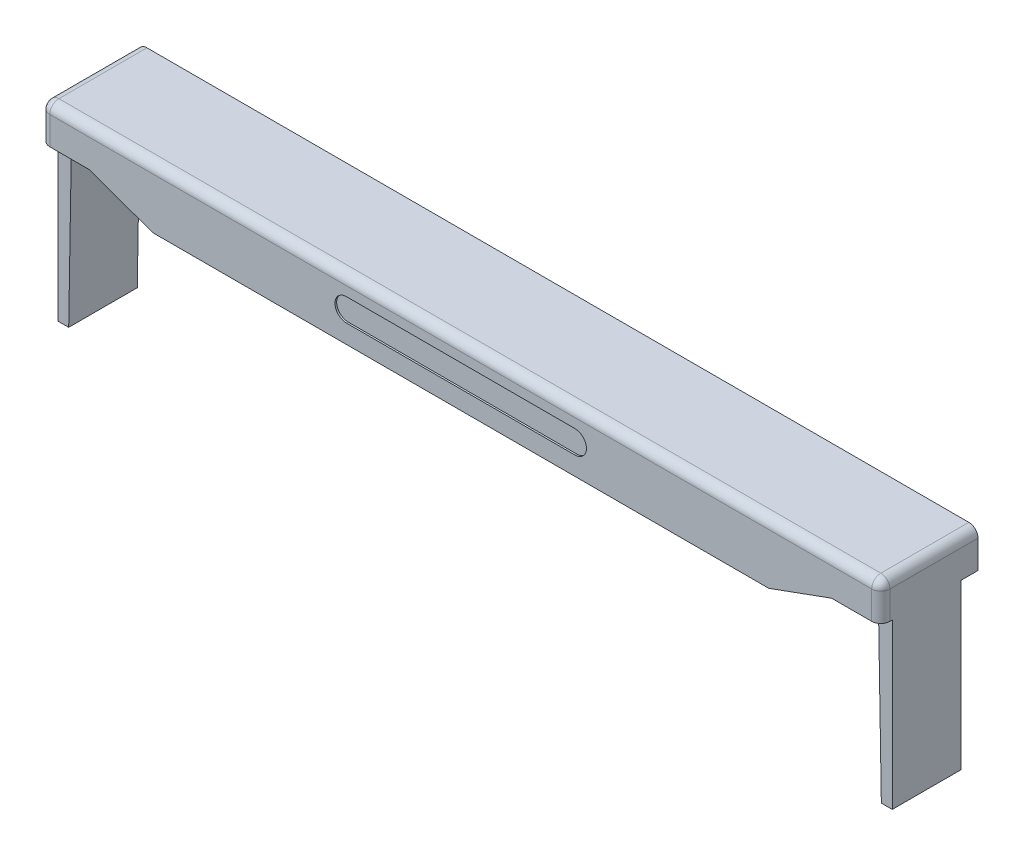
ISO-10303-21;
HEADER;
FILE_DESCRIPTION(('STEP AP214'),'2;1');
FILE_NAME('part.step','',(''),(''),'','','');
FILE_SCHEMA(('AUTOMOTIVE_DESIGN { 1 0 10303 214 1 1 1 1 }'));
ENDSEC;
DATA;
#1=APPLICATION_CONTEXT('core data for automotive mechanical design processes');
#2=APPLICATION_PROTOCOL_DEFINITION('international standard','automotive_design',2000,#1);
#3=PRODUCT_CONTEXT('',#1,'mechanical');
#4=PRODUCT('Part','Part','',(#3));
#5=PRODUCT_RELATED_PRODUCT_CATEGORY('part','',(#4));
#6=PRODUCT_DEFINITION_FORMATION('','',#4);
#7=PRODUCT_DEFINITION_CONTEXT('part definition',#1,'design');
#8=PRODUCT_DEFINITION('design','',#6,#7);
#9=PRODUCT_DEFINITION_SHAPE('','',#8);
#10=(LENGTH_UNIT() NAMED_UNIT(*) SI_UNIT(.MILLI.,.METRE.));
#11=(NAMED_UNIT(*) PLANE_ANGLE_UNIT() SI_UNIT($,.RADIAN.));
#12=(NAMED_UNIT(*) SI_UNIT($,.STERADIAN.) SOLID_ANGLE_UNIT());
#13=UNCERTAINTY_MEASURE_WITH_UNIT(LENGTH_MEASURE(1.E-05),#10,'distance_accuracy_value','');
#14=(GEOMETRIC_REPRESENTATION_CONTEXT(3) GLOBAL_UNCERTAINTY_ASSIGNED_CONTEXT((#13)) GLOBAL_UNIT_ASSIGNED_CONTEXT((#10,
#11,#12)) REPRESENTATION_CONTEXT('',''));
#15=CARTESIAN_POINT('',(0.,0.,0.));
#16=DIRECTION('',(0.,0.,1.));
#17=DIRECTION('',(1.,0.,0.));
#18=AXIS2_PLACEMENT_3D('',#15,#16,#17);
#19=CARTESIAN_POINT('',(0.,-4.,-5.5));
#20=DIRECTION('',(0.,0.,-1.));
#21=DIRECTION('',(0.,1.,0.));
#22=AXIS2_PLACEMENT_3D('',#19,#20,#21);
#23=PLANE('',#22);
#24=DIRECTION('',(-1.,0.,0.));
#25=VECTOR('',#24,1.);
#26=CARTESIAN_POINT('',(71.5885106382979,-28.7,-5.5));
#27=LINE('',#26,#25);
#28=CARTESIAN_POINT('',(73.5,-28.7,-5.5));
#29=VERTEX_POINT('',#28);
#30=CARTESIAN_POINT('',(71.5885106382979,-28.7,-5.5));
#31=VERTEX_POINT('',#30);
#32=EDGE_CURVE('E593',#29,#31,#27,.T.);
#33=ORIENTED_EDGE('',*,*,#32,.T.);
#34=DIRECTION('',(-0.0170188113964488,0.999855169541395,0.));
#35=VECTOR('',#34,1.);
#36=CARTESIAN_POINT('',(71.5885106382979,-28.7,-5.5));
#37=LINE('',#36,#35);
#38=CARTESIAN_POINT('',(71.1,0.,-5.5));
#39=VERTEX_POINT('',#38);
#40=EDGE_CURVE('E483',#31,#39,#37,.T.);
#41=ORIENTED_EDGE('',*,*,#40,.T.);
#42=DIRECTION('',(1.,0.,0.));
#43=VECTOR('',#42,1.);
#44=CARTESIAN_POINT('',(73.5,0.,-5.5));
#45=LINE('',#44,#43);
#46=CARTESIAN_POINT('',(73.5,0.,-5.5));
#47=VERTEX_POINT('',#46);
#48=EDGE_CURVE('E411',#39,#47,#45,.T.);
#49=ORIENTED_EDGE('',*,*,#48,.T.);
#50=DIRECTION('',(0.,-1.,0.));
#51=VECTOR('',#50,1.);
#52=CARTESIAN_POINT('',(73.5,0.,-5.5));
#53=LINE('',#52,#51);
#54=EDGE_CURVE('E319',#47,#29,#53,.T.);
#55=ORIENTED_EDGE('',*,*,#54,.T.);
#56=EDGE_LOOP('',(#33,#41,#49,#55));
#57=FACE_BOUND('',#56,.T.);
#58=ADVANCED_FACE('F16',(#57),#23,.T.);
#59=CARTESIAN_POINT('',(0.,-4.,5.5));
#60=DIRECTION('',(0.,0.,1.));
#61=DIRECTION('',(1.,0.,0.));
#62=AXIS2_PLACEMENT_3D('',#59,#60,#61);
#63=PLANE('',#62);
#64=DIRECTION('',(1.,0.,0.));
#65=VECTOR('',#64,1.);
#66=CARTESIAN_POINT('',(-71.5885106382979,-28.7,5.5));
#67=LINE('',#66,#65);
#68=CARTESIAN_POINT('',(-73.5,-28.7,5.5));
#69=VERTEX_POINT('',#68);
#70=CARTESIAN_POINT('',(-71.5885106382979,-28.7,5.5));
#71=VERTEX_POINT('',#70);
#72=EDGE_CURVE('E255',#69,#71,#67,.T.);
#73=ORIENTED_EDGE('',*,*,#72,.T.);
#74=DIRECTION('',(0.0170188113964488,0.999855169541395,0.));
#75=VECTOR('',#74,1.);
#76=CARTESIAN_POINT('',(-71.5885106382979,-28.7,5.5));
#77=LINE('',#76,#75);
#78=CARTESIAN_POINT('',(-71.1,0.,5.5));
#79=VERTEX_POINT('',#78);
#80=EDGE_CURVE('E246',#71,#79,#77,.T.);
#81=ORIENTED_EDGE('',*,*,#80,.T.);
#82=DIRECTION('',(-1.,0.,0.));
#83=VECTOR('',#82,1.);
#84=CARTESIAN_POINT('',(-73.5,0.,5.5));
#85=LINE('',#84,#83);
#86=CARTESIAN_POINT('',(-73.5,0.,5.5));
#87=VERTEX_POINT('',#86);
#88=EDGE_CURVE('E228',#79,#87,#85,.T.);
#89=ORIENTED_EDGE('',*,*,#88,.T.);
#90=DIRECTION('',(0.,-1.,0.));
#91=VECTOR('',#90,1.);
#92=CARTESIAN_POINT('',(-73.5,0.,5.5));
#93=LINE('',#92,#91);
#94=EDGE_CURVE('E352',#87,#69,#93,.T.);
#95=ORIENTED_EDGE('',*,*,#94,.T.);
#96=EDGE_LOOP('',(#73,#81,#89,#95));
#97=FACE_BOUND('',#96,.T.);
#98=ADVANCED_FACE('F253',(#97),#63,.T.);
#99=CARTESIAN_POINT('',(20.,1.25,8.2));
#100=DIRECTION('',(0.,0.,-1.));
#101=DIRECTION('',(0.,1.,0.));
#102=AXIS2_PLACEMENT_3D('',#99,#100,#101);
#103=PLANE('',#102);
#104=CARTESIAN_POINT('',(20.,1.25,8.2));
#105=DIRECTION('',(0.,0.,-1.));
#106=DIRECTION('',(0.,1.,0.));
#107=AXIS2_PLACEMENT_3D('',#104,#105,#106);
#108=CIRCLE('',#107,2.);
#109=CARTESIAN_POINT('',(20.,3.25,8.2));
#110=VERTEX_POINT('',#109);
#111=CARTESIAN_POINT('',(20.,-0.75000000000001,8.2));
#112=VERTEX_POINT('',#111);
#113=EDGE_CURVE('E452',#110,#112,#108,.T.);
#114=ORIENTED_EDGE('',*,*,#113,.F.);
#115=DIRECTION('',(1.,0.,0.));
#116=VECTOR('',#115,1.);
#117=CARTESIAN_POINT('',(20.,3.25,8.2));
#118=LINE('',#117,#116);
#119=CARTESIAN_POINT('',(-20.,3.25,8.2));
#120=VERTEX_POINT('',#119);
#121=EDGE_CURVE('E11',#120,#110,#118,.T.);
#122=ORIENTED_EDGE('',*,*,#121,.F.);
#123=CARTESIAN_POINT('',(-20.,1.25,8.2));
#124=DIRECTION('',(0.,0.,-1.));
#125=DIRECTION('',(0.,1.,0.));
#126=AXIS2_PLACEMENT_3D('',#123,#124,#125);
#127=CIRCLE('',#126,2.);
#128=CARTESIAN_POINT('',(-20.,-0.750000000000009,8.2));
#129=VERTEX_POINT('',#128);
#130=EDGE_CURVE('E40',#129,#120,#127,.T.);
#131=ORIENTED_EDGE('',*,*,#130,.F.);
#132=DIRECTION('',(-1.,0.,0.));
#133=VECTOR('',#132,1.);
#134=CARTESIAN_POINT('',(20.,-0.75000000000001,8.2));
#135=LINE('',#134,#133);
#136=EDGE_CURVE('E378',#112,#129,#135,.T.);
#137=ORIENTED_EDGE('',*,*,#136,.F.);
#138=EDGE_LOOP('',(#114,#122,#131,#137));
#139=FACE_BOUND('',#138,.T.);
#140=ADVANCED_FACE('F590',(#139),#103,.F.);
#141=CARTESIAN_POINT('',(20.,3.25,8.2));
#142=DIRECTION('',(0.,-1.,0.));
#143=DIRECTION('',(1.,0.,0.));
#144=AXIS2_PLACEMENT_3D('',#141,#142,#143);
#145=PLANE('',#144);
#146=DIRECTION('',(1.,0.,0.));
#147=VECTOR('',#146,1.);
#148=CARTESIAN_POINT('',(20.,3.25,8.5));
#149=LINE('',#148,#147);
#150=CARTESIAN_POINT('',(-20.,3.25,8.5));
#151=VERTEX_POINT('',#150);
#152=CARTESIAN_POINT('',(20.,3.25,8.5));
#153=VERTEX_POINT('',#152);
#154=EDGE_CURVE('E241',#151,#153,#149,.T.);
#155=ORIENTED_EDGE('',*,*,#154,.F.);
#156=DIRECTION('',(0.,0.,1.));
#157=VECTOR('',#156,1.);
#158=CARTESIAN_POINT('',(-20.,3.25,8.2));
#159=LINE('',#158,#157);
#160=EDGE_CURVE('E24',#120,#151,#159,.T.);
#161=ORIENTED_EDGE('',*,*,#160,.F.);
#162=ORIENTED_EDGE('',*,*,#121,.T.);
#163=DIRECTION('',(0.,0.,1.));
#164=VECTOR('',#163,1.);
#165=CARTESIAN_POINT('',(20.,3.25,8.2));
#166=LINE('',#165,#164);
#167=EDGE_CURVE('E449',#110,#153,#166,.T.);
#168=ORIENTED_EDGE('',*,*,#167,.T.);
#169=EDGE_LOOP('',(#155,#161,#162,#168));
#170=FACE_BOUND('',#169,.T.);
#171=ADVANCED_FACE('F854',(#170),#145,.T.);
#172=CARTESIAN_POINT('',(-20.,1.25,8.2));
#173=DIRECTION('',(0.,0.,1.));
#174=DIRECTION('',(0.,-1.,0.));
#175=AXIS2_PLACEMENT_3D('',#172,#173,#174);
#176=CYLINDRICAL_SURFACE('',#175,2.);
#177=CARTESIAN_POINT('',(-20.,1.25,8.5));
#178=DIRECTION('',(0.,0.,-1.));
#179=DIRECTION('',(0.,1.,0.));
#180=AXIS2_PLACEMENT_3D('',#177,#178,#179);
#181=CIRCLE('',#180,2.);
#182=CARTESIAN_POINT('',(-20.,-0.750000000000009,8.5));
#183=VERTEX_POINT('',#182);
#184=EDGE_CURVE('E312',#183,#151,#181,.T.);
#185=ORIENTED_EDGE('',*,*,#184,.F.);
#186=DIRECTION('',(0.,0.,1.));
#187=VECTOR('',#186,1.);
#188=CARTESIAN_POINT('',(-20.,-0.750000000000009,8.2));
#189=LINE('',#188,#187);
#190=EDGE_CURVE('E382',#129,#183,#189,.T.);
#191=ORIENTED_EDGE('',*,*,#190,.F.);
#192=ORIENTED_EDGE('',*,*,#130,.T.);
#193=ORIENTED_EDGE('',*,*,#160,.T.);
#194=EDGE_LOOP('',(#185,#191,#192,#193));
#195=FACE_BOUND('',#194,.T.);
#196=ADVANCED_FACE('F845',(#195),#176,.F.);
#197=CARTESIAN_POINT('',(20.,-0.75000000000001,8.2));
#198=DIRECTION('',(0.,1.,0.));
#199=DIRECTION('',(-1.,0.,0.));
#200=AXIS2_PLACEMENT_3D('',#197,#198,#199);
#201=PLANE('',#200);
#202=DIRECTION('',(-1.,0.,0.));
#203=VECTOR('',#202,1.);
#204=CARTESIAN_POINT('',(20.,-0.75000000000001,8.5));
#205=LINE('',#204,#203);
#206=CARTESIAN_POINT('',(20.,-0.75000000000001,8.5));
#207=VERTEX_POINT('',#206);
#208=EDGE_CURVE('E308',#207,#183,#205,.T.);
#209=ORIENTED_EDGE('',*,*,#208,.F.);
#210=DIRECTION('',(0.,0.,1.));
#211=VECTOR('',#210,1.);
#212=CARTESIAN_POINT('',(20.,-0.75000000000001,8.2));
#213=LINE('',#212,#211);
#214=EDGE_CURVE('E383',#112,#207,#213,.T.);
#215=ORIENTED_EDGE('',*,*,#214,.F.);
#216=ORIENTED_EDGE('',*,*,#136,.T.);
#217=ORIENTED_EDGE('',*,*,#190,.T.);
#218=EDGE_LOOP('',(#209,#215,#216,#217));
#219=FACE_BOUND('',#218,.T.);
#220=ADVANCED_FACE('F835',(#219),#201,.T.);
#221=CARTESIAN_POINT('',(20.,1.25,8.2));
#222=DIRECTION('',(0.,0.,1.));
#223=DIRECTION('',(0.,-1.,0.));
#224=AXIS2_PLACEMENT_3D('',#221,#222,#223);
#225=CYLINDRICAL_SURFACE('',#224,2.);
#226=CARTESIAN_POINT('',(20.,1.25,8.5));
#227=DIRECTION('',(0.,0.,-1.));
#228=DIRECTION('',(0.,1.,0.));
#229=AXIS2_PLACEMENT_3D('',#226,#227,#228);
#230=CIRCLE('',#229,2.);
#231=EDGE_CURVE('E304',#153,#207,#230,.T.);
#232=ORIENTED_EDGE('',*,*,#231,.F.);
#233=ORIENTED_EDGE('',*,*,#167,.F.);
#234=ORIENTED_EDGE('',*,*,#113,.T.);
#235=ORIENTED_EDGE('',*,*,#214,.T.);
#236=EDGE_LOOP('',(#232,#233,#234,#235));
#237=FACE_BOUND('',#236,.T.);
#238=ADVANCED_FACE('F826',(#237),#225,.F.);
#239=CARTESIAN_POINT('',(71.9,4.9,-8.5));
#240=DIRECTION('',(0.,0.,1.));
#241=DIRECTION('',(0.,-1.,0.));
#242=AXIS2_PLACEMENT_3D('',#239,#240,#241);
#243=CYLINDRICAL_SURFACE('',#242,1.6);
#244=CARTESIAN_POINT('',(71.9,4.9,-8.5));
#245=DIRECTION('',(0.,0.,-1.));
#246=DIRECTION('',(0.,1.,0.));
#247=AXIS2_PLACEMENT_3D('',#244,#245,#246);
#248=CIRCLE('',#247,1.6);
#249=CARTESIAN_POINT('',(71.9,6.5,-8.5));
#250=VERTEX_POINT('',#249);
#251=CARTESIAN_POINT('',(73.5,4.9,-8.5));
#252=VERTEX_POINT('',#251);
#253=EDGE_CURVE('E376',#250,#252,#248,.T.);
#254=ORIENTED_EDGE('',*,*,#253,.F.);
#255=DIRECTION('',(0.,0.,-1.));
#256=VECTOR('',#255,1.);
#257=CARTESIAN_POINT('',(71.9,6.5,-8.5));
#258=LINE('',#257,#256);
#259=CARTESIAN_POINT('',(71.9,6.5,6.9));
#260=VERTEX_POINT('',#259);
#261=EDGE_CURVE('E404',#260,#250,#258,.T.);
#262=ORIENTED_EDGE('',*,*,#261,.F.);
#263=CARTESIAN_POINT('',(71.9,4.9,6.9));
#264=DIRECTION('',(0.,0.,-1.));
#265=DIRECTION('',(0.,-1.,0.));
#266=AXIS2_PLACEMENT_3D('',#263,#264,#265);
#267=CIRCLE('',#266,1.6);
#268=CARTESIAN_POINT('',(73.5,4.9,6.9));
#269=VERTEX_POINT('',#268);
#270=EDGE_CURVE('E446',#260,#269,#267,.T.);
#271=ORIENTED_EDGE('',*,*,#270,.T.);
#272=DIRECTION('',(0.,0.,1.));
#273=VECTOR('',#272,1.);
#274=CARTESIAN_POINT('',(73.5,4.9,-8.5));
#275=LINE('',#274,#273);
#276=EDGE_CURVE('E325',#252,#269,#275,.T.);
#277=ORIENTED_EDGE('',*,*,#276,.F.);
#278=EDGE_LOOP('',(#254,#262,#271,#277));
#279=FACE_BOUND('',#278,.T.);
#280=ADVANCED_FACE('F548',(#279),#243,.T.);
#281=CARTESIAN_POINT('',(71.9,4.9,6.9));
#282=DIRECTION('',(0.,0.,1.));
#283=DIRECTION('',(1.,0.,0.));
#284=AXIS2_PLACEMENT_3D('',#281,#282,#283);
#285=SPHERICAL_SURFACE('',#284,1.6);
#286=CARTESIAN_POINT('',(71.9,4.9,6.9));
#287=DIRECTION('',(1.,0.,0.));
#288=DIRECTION('',(0.,1.,0.));
#289=AXIS2_PLACEMENT_3D('',#286,#287,#288);
#290=CIRCLE('',#289,1.6);
#291=CARTESIAN_POINT('',(71.9,4.9,8.5));
#292=VERTEX_POINT('',#291);
#293=EDGE_CURVE('E445',#260,#292,#290,.T.);
#294=ORIENTED_EDGE('',*,*,#293,.T.);
#295=CARTESIAN_POINT('',(71.9,4.9,6.9));
#296=DIRECTION('',(0.,1.,0.));
#297=DIRECTION('',(-1.,0.,0.));
#298=AXIS2_PLACEMENT_3D('',#295,#296,#297);
#299=CIRCLE('',#298,1.6);
#300=EDGE_CURVE('E441',#292,#269,#299,.T.);
#301=ORIENTED_EDGE('',*,*,#300,.T.);
#302=ORIENTED_EDGE('',*,*,#270,.F.);
#303=EDGE_LOOP('',(#294,#301,#302));
#304=FACE_BOUND('',#303,.T.);
#305=ADVANCED_FACE('F809',(#304),#285,.T.);
#306=CARTESIAN_POINT('',(-73.5,4.9,6.9));
#307=DIRECTION('',(1.,0.,0.));
#308=DIRECTION('',(0.,1.,0.));
#309=AXIS2_PLACEMENT_3D('',#306,#307,#308);
#310=CYLINDRICAL_SURFACE('',#309,1.6);
#311=CARTESIAN_POINT('',(-71.9,4.9,6.9));
#312=DIRECTION('',(1.,0.,0.));
#313=DIRECTION('',(0.,-1.,0.));
#314=AXIS2_PLACEMENT_3D('',#311,#312,#313);
#315=CIRCLE('',#314,1.6);
#316=CARTESIAN_POINT('',(-71.9,6.5,6.9));
#317=VERTEX_POINT('',#316);
#318=CARTESIAN_POINT('',(-71.9,4.9,8.5));
#319=VERTEX_POINT('',#318);
#320=EDGE_CURVE('E438',#317,#319,#315,.T.);
#321=ORIENTED_EDGE('',*,*,#320,.T.);
#322=DIRECTION('',(-1.,0.,0.));
#323=VECTOR('',#322,1.);
#324=CARTESIAN_POINT('',(-73.5,4.9,8.5));
#325=LINE('',#324,#323);
#326=EDGE_CURVE('E280',#292,#319,#325,.T.);
#327=ORIENTED_EDGE('',*,*,#326,.F.);
#328=ORIENTED_EDGE('',*,*,#293,.F.);
#329=DIRECTION('',(1.,0.,0.));
#330=VECTOR('',#329,1.);
#331=CARTESIAN_POINT('',(73.5,6.5,6.9));
#332=LINE('',#331,#330);
#333=EDGE_CURVE('E400',#317,#260,#332,.T.);
#334=ORIENTED_EDGE('',*,*,#333,.F.);
#335=EDGE_LOOP('',(#321,#327,#328,#334));
#336=FACE_BOUND('',#335,.T.);
#337=ADVANCED_FACE('F574',(#336),#310,.T.);
#338=CARTESIAN_POINT('',(71.9,-4.,6.9));
#339=DIRECTION('',(0.,1.,0.));
#340=DIRECTION('',(-1.,0.,0.));
#341=AXIS2_PLACEMENT_3D('',#338,#339,#340);
#342=CYLINDRICAL_SURFACE('',#341,1.6);
#343=CARTESIAN_POINT('',(71.9,0.,6.9));
#344=DIRECTION('',(0.,-1.,0.));
#345=DIRECTION('',(1.,0.,0.));
#346=AXIS2_PLACEMENT_3D('',#343,#344,#345);
#347=CIRCLE('',#346,1.6);
#348=CARTESIAN_POINT('',(73.5,0.,6.9));
#349=VERTEX_POINT('',#348);
#350=CARTESIAN_POINT('',(71.9,0.,8.5));
#351=VERTEX_POINT('',#350);
#352=EDGE_CURVE('E423',#349,#351,#347,.T.);
#353=ORIENTED_EDGE('',*,*,#352,.F.);
#354=DIRECTION('',(0.,-1.,0.));
#355=VECTOR('',#354,1.);
#356=CARTESIAN_POINT('',(73.5,0.,6.9));
#357=LINE('',#356,#355);
#358=EDGE_CURVE('E431',#269,#349,#357,.T.);
#359=ORIENTED_EDGE('',*,*,#358,.F.);
#360=ORIENTED_EDGE('',*,*,#300,.F.);
#361=DIRECTION('',(0.,1.,0.));
#362=VECTOR('',#361,1.);
#363=CARTESIAN_POINT('',(71.9,6.5,8.5));
#364=LINE('',#363,#362);
#365=EDGE_CURVE('E276',#351,#292,#364,.T.);
#366=ORIENTED_EDGE('',*,*,#365,.F.);
#367=EDGE_LOOP('',(#353,#359,#360,#366));
#368=FACE_BOUND('',#367,.T.);
#369=ADVANCED_FACE('F568',(#368),#342,.T.);
#370=CARTESIAN_POINT('',(-71.9,4.9,6.9));
#371=DIRECTION('',(0.,0.,1.));
#372=DIRECTION('',(1.,0.,0.));
#373=AXIS2_PLACEMENT_3D('',#370,#371,#372);
#374=SPHERICAL_SURFACE('',#373,1.6);
#375=CARTESIAN_POINT('',(-71.9,4.9,6.9));
#376=DIRECTION('',(0.,0.,1.));
#377=DIRECTION('',(0.,-1.,0.));
#378=AXIS2_PLACEMENT_3D('',#375,#376,#377);
#379=CIRCLE('',#378,1.6);
#380=CARTESIAN_POINT('',(-73.5,4.9,6.9));
#381=VERTEX_POINT('',#380);
#382=EDGE_CURVE('E346',#317,#381,#379,.T.);
#383=ORIENTED_EDGE('',*,*,#382,.T.);
#384=CARTESIAN_POINT('',(-71.9,4.9,6.9));
#385=DIRECTION('',(0.,1.,0.));
#386=DIRECTION('',(-1.,0.,0.));
#387=AXIS2_PLACEMENT_3D('',#384,#385,#386);
#388=CIRCLE('',#387,1.6);
#389=EDGE_CURVE('E342',#381,#319,#388,.T.);
#390=ORIENTED_EDGE('',*,*,#389,.T.);
#391=ORIENTED_EDGE('',*,*,#320,.F.);
#392=EDGE_LOOP('',(#383,#390,#391));
#393=FACE_BOUND('',#392,.T.);
#394=ADVANCED_FACE('F575',(#393),#374,.T.);
#395=CARTESIAN_POINT('',(-71.9,4.9,-8.5));
#396=DIRECTION('',(0.,0.,1.));
#397=DIRECTION('',(0.,-1.,0.));
#398=AXIS2_PLACEMENT_3D('',#395,#396,#397);
#399=CYLINDRICAL_SURFACE('',#398,1.6);
#400=CARTESIAN_POINT('',(-71.9,4.9,-8.5));
#401=DIRECTION('',(0.,0.,-1.));
#402=DIRECTION('',(0.,1.,0.));
#403=AXIS2_PLACEMENT_3D('',#400,#401,#402);
#404=CIRCLE('',#403,1.6);
#405=CARTESIAN_POINT('',(-73.5,4.9,-8.5));
#406=VERTEX_POINT('',#405);
#407=CARTESIAN_POINT('',(-71.9,6.5,-8.5));
#408=VERTEX_POINT('',#407);
#409=EDGE_CURVE('E396',#406,#408,#404,.T.);
#410=ORIENTED_EDGE('',*,*,#409,.F.);
#411=DIRECTION('',(0.,0.,-1.));
#412=VECTOR('',#411,1.);
#413=CARTESIAN_POINT('',(-73.5,4.9,-8.5));
#414=LINE('',#413,#412);
#415=EDGE_CURVE('E357',#381,#406,#414,.T.);
#416=ORIENTED_EDGE('',*,*,#415,.F.);
#417=ORIENTED_EDGE('',*,*,#382,.F.);
#418=DIRECTION('',(0.,0.,1.));
#419=VECTOR('',#418,1.);
#420=CARTESIAN_POINT('',(-71.9,6.5,-8.5));
#421=LINE('',#420,#419);
#422=EDGE_CURVE('E407',#408,#317,#421,.T.);
#423=ORIENTED_EDGE('',*,*,#422,.F.);
#424=EDGE_LOOP('',(#410,#416,#417,#423));
#425=FACE_BOUND('',#424,.T.);
#426=ADVANCED_FACE('F541',(#425),#399,.T.);
#427=CARTESIAN_POINT('',(-71.9,6.5,6.9));
#428=DIRECTION('',(0.,1.,0.));
#429=DIRECTION('',(-1.,0.,0.));
#430=AXIS2_PLACEMENT_3D('',#427,#428,#429);
#431=CYLINDRICAL_SURFACE('',#430,1.6);
#432=CARTESIAN_POINT('',(-71.9,0.,6.9));
#433=DIRECTION('',(0.,-1.,0.));
#434=DIRECTION('',(1.,0.,0.));
#435=AXIS2_PLACEMENT_3D('',#432,#433,#434);
#436=CIRCLE('',#435,1.6);
#437=CARTESIAN_POINT('',(-71.9,0.,8.5));
#438=VERTEX_POINT('',#437);
#439=CARTESIAN_POINT('',(-73.5,0.,6.9));
#440=VERTEX_POINT('',#439);
#441=EDGE_CURVE('E341',#438,#440,#436,.T.);
#442=ORIENTED_EDGE('',*,*,#441,.F.);
#443=DIRECTION('',(0.,-1.,0.));
#444=VECTOR('',#443,1.);
#445=CARTESIAN_POINT('',(-71.9,0.,8.5));
#446=LINE('',#445,#444);
#447=EDGE_CURVE('E284',#319,#438,#446,.T.);
#448=ORIENTED_EDGE('',*,*,#447,.F.);
#449=ORIENTED_EDGE('',*,*,#389,.F.);
#450=DIRECTION('',(0.,1.,0.));
#451=VECTOR('',#450,1.);
#452=CARTESIAN_POINT('',(-73.5,6.5,6.9));
#453=LINE('',#452,#451);
#454=EDGE_CURVE('E353',#440,#381,#453,.T.);
#455=ORIENTED_EDGE('',*,*,#454,.F.);
#456=EDGE_LOOP('',(#442,#448,#449,#455));
#457=FACE_BOUND('',#456,.T.);
#458=ADVANCED_FACE('F537',(#457),#431,.T.);
#459=CARTESIAN_POINT('',(0.,-4.,6.5));
#460=DIRECTION('',(0.,0.,-1.));
#461=DIRECTION('',(0.,1.,0.));
#462=AXIS2_PLACEMENT_3D('',#459,#460,#461);
#463=PLANE('',#462);
#464=DIRECTION('',(0.,-1.,0.));
#465=VECTOR('',#464,1.);
#466=CARTESIAN_POINT('',(73.5,-28.7,6.5));
#467=LINE('',#466,#465);
#468=CARTESIAN_POINT('',(73.5,0.,6.5));
#469=VERTEX_POINT('',#468);
#470=CARTESIAN_POINT('',(73.5,-28.7,6.5));
#471=VERTEX_POINT('',#470);
#472=EDGE_CURVE('E347',#469,#471,#467,.T.);
#473=ORIENTED_EDGE('',*,*,#472,.F.);
#474=DIRECTION('',(1.,0.,0.));
#475=VECTOR('',#474,1.);
#476=CARTESIAN_POINT('',(73.5,0.,6.5));
#477=LINE('',#476,#475);
#478=CARTESIAN_POINT('',(71.1,0.,6.5));
#479=VERTEX_POINT('',#478);
#480=EDGE_CURVE('E415',#479,#469,#477,.T.);
#481=ORIENTED_EDGE('',*,*,#480,.F.);
#482=DIRECTION('',(-0.0170188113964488,0.999855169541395,0.));
#483=VECTOR('',#482,1.);
#484=CARTESIAN_POINT('',(71.5885106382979,-28.7,6.5));
#485=LINE('',#484,#483);
#486=CARTESIAN_POINT('',(71.5885106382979,-28.7,6.5));
#487=VERTEX_POINT('',#486);
#488=EDGE_CURVE('E487',#487,#479,#485,.T.);
#489=ORIENTED_EDGE('',*,*,#488,.F.);
#490=DIRECTION('',(-1.,0.,0.));
#491=VECTOR('',#490,1.);
#492=CARTESIAN_POINT('',(71.5885106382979,-28.7,6.5));
#493=LINE('',#492,#491);
#494=EDGE_CURVE('E473',#471,#487,#493,.T.);
#495=ORIENTED_EDGE('',*,*,#494,.F.);
#496=EDGE_LOOP('',(#473,#481,#489,#495));
#497=FACE_BOUND('',#496,.T.);
#498=ADVANCED_FACE('F603',(#497),#463,.F.);
#499=CARTESIAN_POINT('',(53.9,-4.,8.5));
#500=DIRECTION('',(0.342020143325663,-0.939692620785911,0.));
#501=DIRECTION('',(0.,0.,-1.));
#502=AXIS2_PLACEMENT_3D('',#499,#500,#501);
#503=PLANE('',#502);
#504=DIRECTION('',(0.939692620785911,0.342020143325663,0.));
#505=VECTOR('',#504,1.);
#506=CARTESIAN_POINT('',(74.5818704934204,3.52758524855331,-8.5));
#507=LINE('',#506,#505);
#508=CARTESIAN_POINT('',(53.9,-4.,-8.5));
#509=VERTEX_POINT('',#508);
#510=CARTESIAN_POINT('',(64.8899096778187,0.,-8.5));
#511=VERTEX_POINT('',#510);
#512=EDGE_CURVE('E268',#509,#511,#507,.T.);
#513=ORIENTED_EDGE('',*,*,#512,.T.);
#514=DIRECTION('',(0.,0.,-1.));
#515=VECTOR('',#514,1.);
#516=CARTESIAN_POINT('',(64.8899096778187,0.,8.5));
#517=LINE('',#516,#515);
#518=CARTESIAN_POINT('',(64.8899096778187,0.,8.5));
#519=VERTEX_POINT('',#518);
#520=EDGE_CURVE('E320',#519,#511,#517,.T.);
#521=ORIENTED_EDGE('',*,*,#520,.F.);
#522=DIRECTION('',(0.939692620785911,0.342020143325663,0.));
#523=VECTOR('',#522,1.);
#524=CARTESIAN_POINT('',(53.9,-4.,8.5));
#525=LINE('',#524,#523);
#526=CARTESIAN_POINT('',(53.9,-4.,8.5));
#527=VERTEX_POINT('',#526);
#528=EDGE_CURVE('E300',#527,#519,#525,.T.);
#529=ORIENTED_EDGE('',*,*,#528,.F.);
#530=DIRECTION('',(0.,0.,-1.));
#531=VECTOR('',#530,1.);
#532=CARTESIAN_POINT('',(53.9,-4.,8.5));
#533=LINE('',#532,#531);
#534=EDGE_CURVE('E377',#527,#509,#533,.T.);
#535=ORIENTED_EDGE('',*,*,#534,.T.);
#536=EDGE_LOOP('',(#513,#521,#529,#535));
#537=FACE_BOUND('',#536,.T.);
#538=ADVANCED_FACE('F560',(#537),#503,.T.);
#539=CARTESIAN_POINT('',(73.5,-4.,-8.5));
#540=DIRECTION('',(1.,0.,0.));
#541=DIRECTION('',(0.,-1.,0.));
#542=AXIS2_PLACEMENT_3D('',#539,#540,#541);
#543=PLANE('',#542);
#544=ORIENTED_EDGE('',*,*,#54,.F.);
#545=DIRECTION('',(0.,0.,-1.));
#546=VECTOR('',#545,1.);
#547=CARTESIAN_POINT('',(73.5,0.,8.5));
#548=LINE('',#547,#546);
#549=CARTESIAN_POINT('',(73.5,0.,-8.5));
#550=VERTEX_POINT('',#549);
#551=EDGE_CURVE('E316',#47,#550,#548,.T.);
#552=ORIENTED_EDGE('',*,*,#551,.T.);
#553=DIRECTION('',(0.,-1.,0.));
#554=VECTOR('',#553,1.);
#555=CARTESIAN_POINT('',(73.5,-4.,-8.5));
#556=LINE('',#555,#554);
#557=EDGE_CURVE('E387',#252,#550,#556,.T.);
#558=ORIENTED_EDGE('',*,*,#557,.F.);
#559=ORIENTED_EDGE('',*,*,#276,.T.);
#560=ORIENTED_EDGE('',*,*,#358,.T.);
#561=DIRECTION('',(0.,0.,-1.));
#562=VECTOR('',#561,1.);
#563=CARTESIAN_POINT('',(73.5,0.,8.5));
#564=LINE('',#563,#562);
#565=EDGE_CURVE('E419',#349,#469,#564,.T.);
#566=ORIENTED_EDGE('',*,*,#565,.T.);
#567=ORIENTED_EDGE('',*,*,#472,.T.);
#568=DIRECTION('',(0.,0.,-1.));
#569=VECTOR('',#568,1.);
#570=CARTESIAN_POINT('',(73.5,-28.7,6.5));
#571=LINE('',#570,#569);
#572=EDGE_CURVE('E470',#471,#29,#571,.T.);
#573=ORIENTED_EDGE('',*,*,#572,.T.);
#574=EDGE_LOOP('',(#544,#552,#558,#559,#560,#566,#567,#573));
#575=FACE_BOUND('',#574,.T.);
#576=ADVANCED_FACE('F552',(#575),#543,.T.);
#577=CARTESIAN_POINT('',(64.8899096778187,0.,8.5));
#578=DIRECTION('',(0.,-1.,0.));
#579=DIRECTION('',(1.,0.,0.));
#580=AXIS2_PLACEMENT_3D('',#577,#578,#579);
#581=PLANE('',#580);
#582=ORIENTED_EDGE('',*,*,#48,.F.);
#583=DIRECTION('',(0.,0.,-1.));
#584=VECTOR('',#583,1.);
#585=CARTESIAN_POINT('',(71.1,0.,6.5));
#586=LINE('',#585,#584);
#587=EDGE_CURVE('E491',#479,#39,#586,.T.);
#588=ORIENTED_EDGE('',*,*,#587,.F.);
#589=ORIENTED_EDGE('',*,*,#480,.T.);
#590=ORIENTED_EDGE('',*,*,#565,.F.);
#591=ORIENTED_EDGE('',*,*,#352,.T.);
#592=DIRECTION('',(1.,0.,0.));
#593=VECTOR('',#592,1.);
#594=CARTESIAN_POINT('',(64.8899096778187,0.,8.5));
#595=LINE('',#594,#593);
#596=EDGE_CURVE('E250',#519,#351,#595,.T.);
#597=ORIENTED_EDGE('',*,*,#596,.F.);
#598=ORIENTED_EDGE('',*,*,#520,.T.);
#599=DIRECTION('',(1.,0.,0.));
#600=VECTOR('',#599,1.);
#601=CARTESIAN_POINT('',(73.5,0.,-8.5));
#602=LINE('',#601,#600);
#603=EDGE_CURVE('E272',#511,#550,#602,.T.);
#604=ORIENTED_EDGE('',*,*,#603,.T.);
#605=ORIENTED_EDGE('',*,*,#551,.F.);
#606=EDGE_LOOP('',(#582,#588,#589,#590,#591,#597,#598,#604,#605));
#607=FACE_BOUND('',#606,.T.);
#608=ADVANCED_FACE('F556',(#607),#581,.T.);
#609=CARTESIAN_POINT('',(0.,-4.,-6.5));
#610=DIRECTION('',(0.,0.,-1.));
#611=DIRECTION('',(0.,1.,0.));
#612=AXIS2_PLACEMENT_3D('',#609,#610,#611);
#613=PLANE('',#612);
#614=DIRECTION('',(1.,0.,0.));
#615=VECTOR('',#614,1.);
#616=CARTESIAN_POINT('',(-71.5885106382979,-28.7,-6.5));
#617=LINE('',#616,#615);
#618=CARTESIAN_POINT('',(-73.5,-28.7,-6.5));
#619=VERTEX_POINT('',#618);
#620=CARTESIAN_POINT('',(-71.5885106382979,-28.7,-6.5));
#621=VERTEX_POINT('',#620);
#622=EDGE_CURVE('E264',#619,#621,#617,.T.);
#623=ORIENTED_EDGE('',*,*,#622,.F.);
#624=DIRECTION('',(0.,-1.,0.));
#625=VECTOR('',#624,1.);
#626=CARTESIAN_POINT('',(-73.5,0.,-6.5));
#627=LINE('',#626,#625);
#628=CARTESIAN_POINT('',(-73.5,0.,-6.5));
#629=VERTEX_POINT('',#628);
#630=EDGE_CURVE('E364',#629,#619,#627,.T.);
#631=ORIENTED_EDGE('',*,*,#630,.F.);
#632=DIRECTION('',(-1.,0.,0.));
#633=VECTOR('',#632,1.);
#634=CARTESIAN_POINT('',(-73.5,0.,-6.5));
#635=LINE('',#634,#633);
#636=CARTESIAN_POINT('',(-71.1,0.,-6.5));
#637=VERTEX_POINT('',#636);
#638=EDGE_CURVE('E240',#637,#629,#635,.T.);
#639=ORIENTED_EDGE('',*,*,#638,.F.);
#640=DIRECTION('',(0.0170188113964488,0.999855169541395,0.));
#641=VECTOR('',#640,1.);
#642=CARTESIAN_POINT('',(-71.5885106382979,-28.7,-6.5));
#643=LINE('',#642,#641);
#644=EDGE_CURVE('E248',#621,#637,#643,.T.);
#645=ORIENTED_EDGE('',*,*,#644,.F.);
#646=EDGE_LOOP('',(#623,#631,#639,#645));
#647=FACE_BOUND('',#646,.T.);
#648=ADVANCED_FACE('F516',(#647),#613,.T.);
#649=CARTESIAN_POINT('',(-53.9,-4.,8.5));
#650=DIRECTION('',(-0.342020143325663,-0.939692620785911,0.));
#651=DIRECTION('',(0.,0.,1.));
#652=AXIS2_PLACEMENT_3D('',#649,#650,#651);
#653=PLANE('',#652);
#654=DIRECTION('',(-0.939692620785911,0.342020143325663,0.));
#655=VECTOR('',#654,1.);
#656=CARTESIAN_POINT('',(-74.5818704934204,3.52758524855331,-8.5));
#657=LINE('',#656,#655);
#658=CARTESIAN_POINT('',(-53.9,-4.,-8.5));
#659=VERTEX_POINT('',#658);
#660=CARTESIAN_POINT('',(-64.8899096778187,0.,-8.5));
#661=VERTEX_POINT('',#660);
#662=EDGE_CURVE('E271',#659,#661,#657,.T.);
#663=ORIENTED_EDGE('',*,*,#662,.F.);
#664=DIRECTION('',(0.,0.,-1.));
#665=VECTOR('',#664,1.);
#666=CARTESIAN_POINT('',(-53.9,-4.,8.5));
#667=LINE('',#666,#665);
#668=CARTESIAN_POINT('',(-53.9,-4.,8.5));
#669=VERTEX_POINT('',#668);
#670=EDGE_CURVE('E367',#669,#659,#667,.T.);
#671=ORIENTED_EDGE('',*,*,#670,.F.);
#672=DIRECTION('',(-0.939692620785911,0.342020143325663,0.));
#673=VECTOR('',#672,1.);
#674=CARTESIAN_POINT('',(-53.9,-4.,8.5));
#675=LINE('',#674,#673);
#676=CARTESIAN_POINT('',(-64.8899096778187,0.,8.5));
#677=VERTEX_POINT('',#676);
#678=EDGE_CURVE('E292',#669,#677,#675,.T.);
#679=ORIENTED_EDGE('',*,*,#678,.T.);
#680=DIRECTION('',(0.,0.,-1.));
#681=VECTOR('',#680,1.);
#682=CARTESIAN_POINT('',(-64.8899096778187,0.,8.5));
#683=LINE('',#682,#681);
#684=EDGE_CURVE('E337',#677,#661,#683,.T.);
#685=ORIENTED_EDGE('',*,*,#684,.T.);
#686=EDGE_LOOP('',(#663,#671,#679,#685));
#687=FACE_BOUND('',#686,.T.);
#688=ADVANCED_FACE('F528',(#687),#653,.T.);
#689=CARTESIAN_POINT('',(-73.5,6.5,-8.5));
#690=DIRECTION('',(0.,1.,0.));
#691=DIRECTION('',(-1.,0.,0.));
#692=AXIS2_PLACEMENT_3D('',#689,#690,#691);
#693=PLANE('',#692);
#694=ORIENTED_EDGE('',*,*,#333,.T.);
#695=ORIENTED_EDGE('',*,*,#261,.T.);
#696=DIRECTION('',(-1.,0.,0.));
#697=VECTOR('',#696,1.);
#698=CARTESIAN_POINT('',(-73.5,6.5,-8.5));
#699=LINE('',#698,#697);
#700=EDGE_CURVE('E372',#250,#408,#699,.T.);
#701=ORIENTED_EDGE('',*,*,#700,.T.);
#702=ORIENTED_EDGE('',*,*,#422,.T.);
#703=EDGE_LOOP('',(#694,#695,#701,#702));
#704=FACE_BOUND('',#703,.T.);
#705=ADVANCED_FACE('F543',(#704),#693,.T.);
#706=CARTESIAN_POINT('',(-73.5,6.5,-8.5));
#707=DIRECTION('',(0.,0.,-1.));
#708=DIRECTION('',(0.,1.,0.));
#709=AXIS2_PLACEMENT_3D('',#706,#707,#708);
#710=PLANE('',#709);
#711=ORIENTED_EDGE('',*,*,#700,.F.);
#712=ORIENTED_EDGE('',*,*,#253,.T.);
#713=ORIENTED_EDGE('',*,*,#557,.T.);
#714=ORIENTED_EDGE('',*,*,#603,.F.);
#715=ORIENTED_EDGE('',*,*,#512,.F.);
#716=DIRECTION('',(1.,0.,0.));
#717=VECTOR('',#716,1.);
#718=CARTESIAN_POINT('',(-73.5,-4.,-8.5));
#719=LINE('',#718,#717);
#720=EDGE_CURVE('E371',#659,#509,#719,.T.);
#721=ORIENTED_EDGE('',*,*,#720,.F.);
#722=ORIENTED_EDGE('',*,*,#662,.T.);
#723=DIRECTION('',(-1.,0.,0.));
#724=VECTOR('',#723,1.);
#725=CARTESIAN_POINT('',(-73.5,0.,-8.5));
#726=LINE('',#725,#724);
#727=CARTESIAN_POINT('',(-73.5,0.,-8.5));
#728=VERTEX_POINT('',#727);
#729=EDGE_CURVE('E333',#661,#728,#726,.T.);
#730=ORIENTED_EDGE('',*,*,#729,.T.);
#731=DIRECTION('',(0.,-1.,0.));
#732=VECTOR('',#731,1.);
#733=CARTESIAN_POINT('',(-73.5,-4.,-8.5));
#734=LINE('',#733,#732);
#735=EDGE_CURVE('E361',#406,#728,#734,.T.);
#736=ORIENTED_EDGE('',*,*,#735,.F.);
#737=ORIENTED_EDGE('',*,*,#409,.T.);
#738=EDGE_LOOP('',(#711,#712,#713,#714,#715,#721,#722,#730,#736,#737));
#739=FACE_BOUND('',#738,.T.);
#740=ADVANCED_FACE('F525',(#739),#710,.T.);
#741=CARTESIAN_POINT('',(-73.5,-4.,-8.5));
#742=DIRECTION('',(0.,-1.,0.));
#743=DIRECTION('',(1.,0.,0.));
#744=AXIS2_PLACEMENT_3D('',#741,#742,#743);
#745=PLANE('',#744);
#746=DIRECTION('',(1.,0.,0.));
#747=VECTOR('',#746,1.);
#748=CARTESIAN_POINT('',(-73.5,-4.,8.5));
#749=LINE('',#748,#747);
#750=EDGE_CURVE('E296',#669,#527,#749,.T.);
#751=ORIENTED_EDGE('',*,*,#750,.F.);
#752=ORIENTED_EDGE('',*,*,#670,.T.);
#753=ORIENTED_EDGE('',*,*,#720,.T.);
#754=ORIENTED_EDGE('',*,*,#534,.F.);
#755=EDGE_LOOP('',(#751,#752,#753,#754));
#756=FACE_BOUND('',#755,.T.);
#757=ADVANCED_FACE('F563',(#756),#745,.T.);
#758=CARTESIAN_POINT('',(-73.5,-4.,-8.5));
#759=DIRECTION('',(-1.,0.,0.));
#760=DIRECTION('',(0.,-1.,0.));
#761=AXIS2_PLACEMENT_3D('',#758,#759,#760);
#762=PLANE('',#761);
#763=ORIENTED_EDGE('',*,*,#94,.F.);
#764=DIRECTION('',(0.,0.,-1.));
#765=VECTOR('',#764,1.);
#766=CARTESIAN_POINT('',(-73.5,0.,8.5));
#767=LINE('',#766,#765);
#768=EDGE_CURVE('E236',#440,#87,#767,.T.);
#769=ORIENTED_EDGE('',*,*,#768,.F.);
#770=ORIENTED_EDGE('',*,*,#454,.T.);
#771=ORIENTED_EDGE('',*,*,#415,.T.);
#772=ORIENTED_EDGE('',*,*,#735,.T.);
#773=DIRECTION('',(0.,0.,-1.));
#774=VECTOR('',#773,1.);
#775=CARTESIAN_POINT('',(-73.5,0.,8.5));
#776=LINE('',#775,#774);
#777=EDGE_CURVE('E329',#629,#728,#776,.T.);
#778=ORIENTED_EDGE('',*,*,#777,.F.);
#779=ORIENTED_EDGE('',*,*,#630,.T.);
#780=DIRECTION('',(0.,0.,-1.));
#781=VECTOR('',#780,1.);
#782=CARTESIAN_POINT('',(-73.5,-28.7,6.5));
#783=LINE('',#782,#781);
#784=EDGE_CURVE('E499',#69,#619,#783,.T.);
#785=ORIENTED_EDGE('',*,*,#784,.F.);
#786=EDGE_LOOP('',(#763,#769,#770,#771,#772,#778,#779,#785));
#787=FACE_BOUND('',#786,.T.);
#788=ADVANCED_FACE('F520',(#787),#762,.T.);
#789=CARTESIAN_POINT('',(-64.8899096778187,0.,8.5));
#790=DIRECTION('',(0.,-1.,0.));
#791=DIRECTION('',(1.,0.,0.));
#792=AXIS2_PLACEMENT_3D('',#789,#790,#791);
#793=PLANE('',#792);
#794=ORIENTED_EDGE('',*,*,#88,.F.);
#795=DIRECTION('',(0.,0.,-1.));
#796=VECTOR('',#795,1.);
#797=CARTESIAN_POINT('',(-71.1,0.,6.5));
#798=LINE('',#797,#796);
#799=EDGE_CURVE('E232',#79,#637,#798,.T.);
#800=ORIENTED_EDGE('',*,*,#799,.T.);
#801=ORIENTED_EDGE('',*,*,#638,.T.);
#802=ORIENTED_EDGE('',*,*,#777,.T.);
#803=ORIENTED_EDGE('',*,*,#729,.F.);
#804=ORIENTED_EDGE('',*,*,#684,.F.);
#805=DIRECTION('',(-1.,0.,0.));
#806=VECTOR('',#805,1.);
#807=CARTESIAN_POINT('',(-64.8899096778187,0.,8.5));
#808=LINE('',#807,#806);
#809=EDGE_CURVE('E288',#677,#438,#808,.T.);
#810=ORIENTED_EDGE('',*,*,#809,.T.);
#811=ORIENTED_EDGE('',*,*,#441,.T.);
#812=ORIENTED_EDGE('',*,*,#768,.T.);
#813=EDGE_LOOP('',(#794,#800,#801,#802,#803,#804,#810,#811,#812));
#814=FACE_BOUND('',#813,.T.);
#815=ADVANCED_FACE('F230',(#814),#793,.T.);
#816=CARTESIAN_POINT('',(-73.5,6.5,8.5));
#817=DIRECTION('',(0.,0.,-1.));
#818=DIRECTION('',(0.,1.,0.));
#819=AXIS2_PLACEMENT_3D('',#816,#817,#818);
#820=PLANE('',#819);
#821=ORIENTED_EDGE('',*,*,#231,.T.);
#822=ORIENTED_EDGE('',*,*,#208,.T.);
#823=ORIENTED_EDGE('',*,*,#184,.T.);
#824=ORIENTED_EDGE('',*,*,#154,.T.);
#825=EDGE_LOOP('',(#821,#822,#823,#824));
#826=FACE_BOUND('',#825,.T.);
#827=ORIENTED_EDGE('',*,*,#596,.T.);
#828=ORIENTED_EDGE('',*,*,#365,.T.);
#829=ORIENTED_EDGE('',*,*,#326,.T.);
#830=ORIENTED_EDGE('',*,*,#447,.T.);
#831=ORIENTED_EDGE('',*,*,#809,.F.);
#832=ORIENTED_EDGE('',*,*,#678,.F.);
#833=ORIENTED_EDGE('',*,*,#750,.T.);
#834=ORIENTED_EDGE('',*,*,#528,.T.);
#835=EDGE_LOOP('',(#827,#828,#829,#830,#831,#832,#833,#834));
#836=FACE_BOUND('',#835,.T.);
#837=ADVANCED_FACE('F533',(#826,#836),#820,.F.);
#838=CARTESIAN_POINT('',(-71.5885106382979,-28.7,6.5));
#839=DIRECTION('',(-0.999855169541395,0.0170188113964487,0.));
#840=DIRECTION('',(-0.0170188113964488,-0.999855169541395,0.));
#841=AXIS2_PLACEMENT_3D('',#838,#839,#840);
#842=PLANE('',#841);
#843=ORIENTED_EDGE('',*,*,#80,.F.);
#844=DIRECTION('',(0.,0.,-1.));
#845=VECTOR('',#844,1.);
#846=CARTESIAN_POINT('',(-71.5885106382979,-28.7,6.5));
#847=LINE('',#846,#845);
#848=EDGE_CURVE('E257',#71,#621,#847,.T.);
#849=ORIENTED_EDGE('',*,*,#848,.T.);
#850=ORIENTED_EDGE('',*,*,#644,.T.);
#851=ORIENTED_EDGE('',*,*,#799,.F.);
#852=EDGE_LOOP('',(#843,#849,#850,#851));
#853=FACE_BOUND('',#852,.T.);
#854=ADVANCED_FACE('F244',(#853),#842,.F.);
#855=CARTESIAN_POINT('',(-71.5885106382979,-28.7,6.5));
#856=DIRECTION('',(0.,1.,0.));
#857=DIRECTION('',(-1.,0.,0.));
#858=AXIS2_PLACEMENT_3D('',#855,#856,#857);
#859=PLANE('',#858);
#860=ORIENTED_EDGE('',*,*,#72,.F.);
#861=ORIENTED_EDGE('',*,*,#784,.T.);
#862=ORIENTED_EDGE('',*,*,#622,.T.);
#863=ORIENTED_EDGE('',*,*,#848,.F.);
#864=EDGE_LOOP('',(#860,#861,#862,#863));
#865=FACE_BOUND('',#864,.T.);
#866=ADVANCED_FACE('F513',(#865),#859,.F.);
#867=CARTESIAN_POINT('',(71.5885106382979,-28.7,6.5));
#868=DIRECTION('',(0.999855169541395,0.0170188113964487,0.));
#869=DIRECTION('',(0.,0.,-1.));
#870=AXIS2_PLACEMENT_3D('',#867,#868,#869);
#871=PLANE('',#870);
#872=ORIENTED_EDGE('',*,*,#40,.F.);
#873=DIRECTION('',(0.,0.,-1.));
#874=VECTOR('',#873,1.);
#875=CARTESIAN_POINT('',(71.5885106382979,-28.7,6.5));
#876=LINE('',#875,#874);
#877=EDGE_CURVE('E476',#487,#31,#876,.T.);
#878=ORIENTED_EDGE('',*,*,#877,.F.);
#879=ORIENTED_EDGE('',*,*,#488,.T.);
#880=ORIENTED_EDGE('',*,*,#587,.T.);
#881=EDGE_LOOP('',(#872,#878,#879,#880));
#882=FACE_BOUND('',#881,.T.);
#883=ADVANCED_FACE('F606',(#882),#871,.F.);
#884=CARTESIAN_POINT('',(71.5885106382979,-28.7,6.5));
#885=DIRECTION('',(0.,1.,0.));
#886=DIRECTION('',(-1.,0.,0.));
#887=AXIS2_PLACEMENT_3D('',#884,#885,#886);
#888=PLANE('',#887);
#889=ORIENTED_EDGE('',*,*,#32,.F.);
#890=ORIENTED_EDGE('',*,*,#572,.F.);
#891=ORIENTED_EDGE('',*,*,#494,.T.);
#892=ORIENTED_EDGE('',*,*,#877,.T.);
#893=EDGE_LOOP('',(#889,#890,#891,#892));
#894=FACE_BOUND('',#893,.T.);
#895=ADVANCED_FACE('F600',(#894),#888,.F.);
#896=CLOSED_SHELL('',(#58,#98,#140,#171,#196,#220,#238,#280,#305,#337,#369,#394,#426,#458,#498,
#538,#576,#608,#648,#688,#705,#740,#757,#788,#815,#837,#854,#866,#883,#895));
#897=MANIFOLD_SOLID_BREP('B1',#896);
#898=ADVANCED_BREP_SHAPE_REPRESENTATION('',(#18,#897),#14);
#899=SHAPE_DEFINITION_REPRESENTATION(#9,#898);
ENDSEC;
END-ISO-10303-21;
